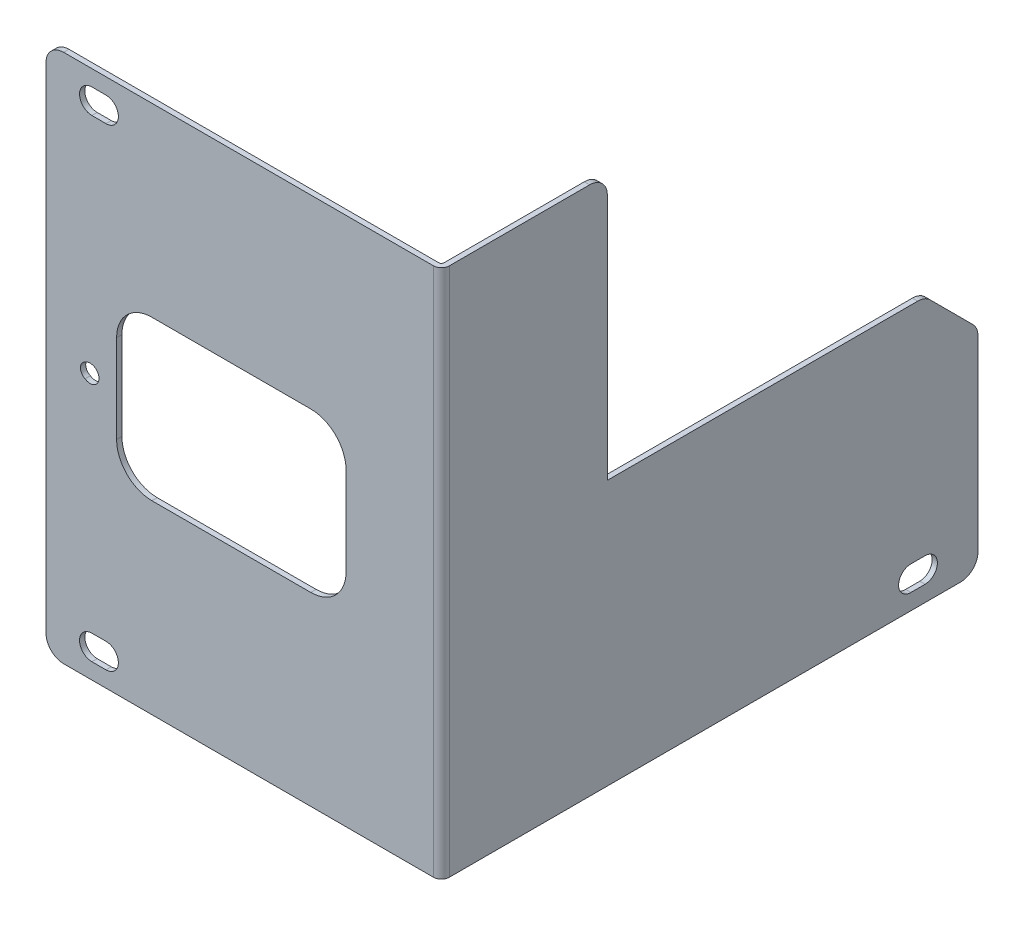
from build123d import *

# Parameters (mm, degrees)
BOSS_EXTRU_1_DEPTH              = 1.5
ESQUISSE2_W                     = 1.5
ESQUISSE2_H                     = 47
BOSS_EXTRU_2_DEPTH              = 75
ESQUISSE3_W                     = 1.5
ESQUISSE3_H                     = 150
BOSS_EXTRU_3_DEPTH              = 110.5
DIAM_TRE_DU_PER_AGE_4_5_4_5_1_D = 4.5
ENL_V_MAT_EXTRU_1_DEPTH         = 202.21008921
ENL_V_MAT_EXTRU_2_DEPTH         = 202.21008921
ESQUISSE8_W                     = 65
ESQUISSE8_H                     = 45
ENL_V_MAT_EXTRU_3_DEPTH         = 202.21008921
ENL_V_MAT_EXTRU_4_DEPTH         = 202.21008921
ESQUISSE10_W                    = 2.5
ESQUISSE10_H                    = 1.5
CONG_1_R                        = 0.75
CONG_2_R                        = 2.25
CONG_3_R                        = 5
CONG_4_R                        = 10


with BuildPart() as part:
    # Esquisse1 → Boss.-Extru.1 (new body)
    with BuildSketch(Plane(origin=(1.5, 0, 0), x_dir=(0, 0, -1), z_dir=(1, 0, 0))):
        Polygon((135.5, 0), (-1.5, 0), (-1.5, -75), (150.5, -75), (150.5, -15), align=None)
    extrude(amount=-BOSS_EXTRU_1_DEPTH)

    # Esquisse2 → Boss.-Extru.2 (add)
    with BuildSketch(Plane(origin=(0, 0, 0), x_dir=(-1, 0, 0), z_dir=(0, 1, 0))):
        with Locations((-0.75, -22)):
            Rectangle(ESQUISSE2_W, ESQUISSE2_H)
    extrude(amount=BOSS_EXTRU_2_DEPTH)

    # Esquisse3 → Boss.-Extru.3 (add)
    with BuildSketch(Plane.ZY):
        with Locations((0.75, 0)):
            Rectangle(ESQUISSE3_W, ESQUISSE3_H)
    extrude(amount=BOSS_EXTRU_3_DEPTH)

    # Diam_tre du per_age _4.5 _4.5_1 (through all)
    with Locations(Plane(origin=(0, 0, 0), x_dir=(-1, 0, 0), z_dir=(0, 0, -1))):
        with Locations((98.5, 0)):
            Hole(DIAM_TRE_DU_PER_AGE_4_5_4_5_1_D / 2)

    # Esquisse6 → Enl_v. mat.-Extru.1 (cut, through all)
    with BuildSketch(Plane(origin=(0, 0, 0), x_dir=(-1, 0, 0), z_dir=(0, 0, -1))):
        with BuildLine():
            Line((97.5, -63.5), (93.5, -63.5))
            ThreePointArc((93.5, -63.5), (90, -67), (93.5, -70.5))
            Line((93.5, -70.5), (97.5, -70.5))
            ThreePointArc((97.5, -70.5), (101, -67), (97.5, -63.5))
        make_face()
    extrude(amount=-ENL_V_MAT_EXTRU_1_DEPTH, mode=Mode.SUBTRACT)

    # Esquisse7 → Enl_v. mat.-Extru.2 (cut, through all)
    with BuildSketch(Plane(origin=(0, 0, 0), x_dir=(-1, 0, 0), z_dir=(0, 0, -1))):
        with BuildLine():
            Line((97.5, 70.5), (93.5, 70.5))
            ThreePointArc((93.5, 70.5), (90, 67), (93.5, 63.5))
            Line((93.5, 63.5), (97.5, 63.5))
            ThreePointArc((97.5, 63.5), (101, 67), (97.5, 70.5))
        make_face()
    extrude(amount=-ENL_V_MAT_EXTRU_2_DEPTH, mode=Mode.SUBTRACT)

    # Esquisse8 → Enl_v. mat.-Extru.3 (cut, through all)
    with BuildSketch(Plane(origin=(0, 0, 0), x_dir=(-1, 0, 0), z_dir=(0, 0, -1))):
        with Locations((58, 0)):
            Rectangle(ESQUISSE8_W, ESQUISSE8_H)
    extrude(amount=-ENL_V_MAT_EXTRU_3_DEPTH, mode=Mode.SUBTRACT)

    # Esquisse9 → Enl_v. mat.-Extru.4 (cut, through all)
    with BuildSketch(Plane.ZY):
        with BuildLine():
            Line((-131.5, -63.5), (-135.5, -63.5))
            ThreePointArc((-135.5, -63.5), (-139, -67), (-135.5, -70.5))
            Line((-135.5, -70.5), (-131.5, -70.5))
            ThreePointArc((-131.5, -70.5), (-128, -67), (-131.5, -63.5))
        make_face()
    extrude(amount=-ENL_V_MAT_EXTRU_4_DEPTH, mode=Mode.SUBTRACT)

    # Esquisse10 → Enl_vement de mati_re-R_volution1 (revolve, cut)
    with BuildSketch(Plane.XZ):
        with Locations((-96.75, 0.75)):
            Rectangle(ESQUISSE10_W, ESQUISSE10_H)
    revolve(axis=Axis((-98, 0, 1.5), (0, 0, -1)), mode=Mode.SUBTRACT)

    # Cong_1
    cong_1_edges = [part.edges().sort_by_distance(p)[0] for p in [
        (0, 0, 0),
    ]]
    fillet(cong_1_edges, radius=CONG_1_R)

    # Cong_2
    cong_2_edges = [part.edges().sort_by_distance(p)[0] for p in [
        (1.5, 0, 1.5),
    ]]
    fillet(cong_2_edges, radius=CONG_2_R)

    # Cong_3
    cong_3_edges = [part.edges().sort_by_distance(p)[0] for p in [
        (0.75, 75, -45.5),
        (0.75, -15, -150.5),
        (0.75, 0, -135.5),
        (-110.5, -75, 0.75),
        (0.75, -75, -150.5),
        (-110.5, 75, 0.75),
    ]]
    fillet(cong_3_edges, radius=CONG_3_R)

    # Cong_4
    cong_4_edges = [part.edges().sort_by_distance(p)[0] for p in [
        (-25.5, 22.5, 0.75),
        (-90.5, 22.5, 0.75),
        (-90.5, -22.5, 0.75),
        (-25.5, -22.5, 0.75),
    ]]
    fillet(cong_4_edges, radius=CONG_4_R)


solid = part.part
